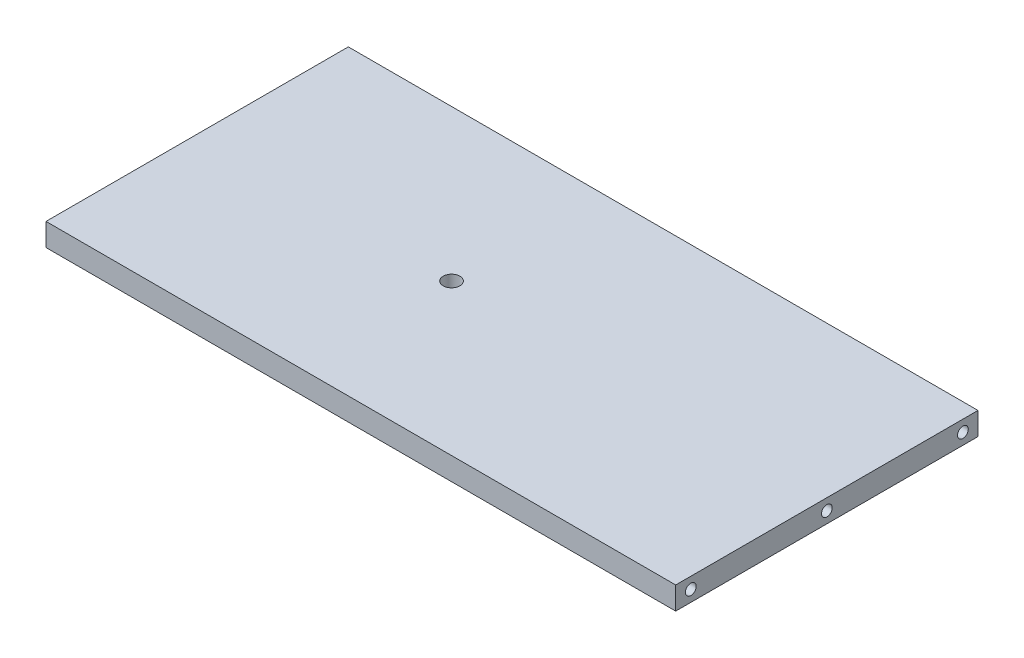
ISO-10303-21;
HEADER;
FILE_DESCRIPTION(('STEP AP214'),'2;1');
FILE_NAME('part.step','',(''),(''),'','','');
FILE_SCHEMA(('AUTOMOTIVE_DESIGN { 1 0 10303 214 1 1 1 1 }'));
ENDSEC;
DATA;
#1=APPLICATION_CONTEXT('core data for automotive mechanical design processes');
#2=APPLICATION_PROTOCOL_DEFINITION('international standard','automotive_design',2000,#1);
#3=PRODUCT_CONTEXT('',#1,'mechanical');
#4=PRODUCT('Part','Part','',(#3));
#5=PRODUCT_RELATED_PRODUCT_CATEGORY('part','',(#4));
#6=PRODUCT_DEFINITION_FORMATION('','',#4);
#7=PRODUCT_DEFINITION_CONTEXT('part definition',#1,'design');
#8=PRODUCT_DEFINITION('design','',#6,#7);
#9=PRODUCT_DEFINITION_SHAPE('','',#8);
#10=(LENGTH_UNIT() NAMED_UNIT(*) SI_UNIT(.MILLI.,.METRE.));
#11=(NAMED_UNIT(*) PLANE_ANGLE_UNIT() SI_UNIT($,.RADIAN.));
#12=(NAMED_UNIT(*) SI_UNIT($,.STERADIAN.) SOLID_ANGLE_UNIT());
#13=UNCERTAINTY_MEASURE_WITH_UNIT(LENGTH_MEASURE(1.E-05),#10,'distance_accuracy_value','');
#14=(GEOMETRIC_REPRESENTATION_CONTEXT(3) GLOBAL_UNCERTAINTY_ASSIGNED_CONTEXT((#13)) GLOBAL_UNIT_ASSIGNED_CONTEXT((#10,
#11,#12)) REPRESENTATION_CONTEXT('',''));
#15=CARTESIAN_POINT('',(0.,0.,0.));
#16=DIRECTION('',(0.,0.,1.));
#17=DIRECTION('',(1.,0.,0.));
#18=AXIS2_PLACEMENT_3D('',#15,#16,#17);
#19=CARTESIAN_POINT('',(66.13525,4.7625,31.75));
#20=DIRECTION('',(-1.,0.,0.));
#21=DIRECTION('',(0.,0.,1.));
#22=AXIS2_PLACEMENT_3D('',#19,#20,#21);
#23=PLANE('',#22);
#24=CARTESIAN_POINT('',(66.13525,2.38125000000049,28.575));
#25=DIRECTION('',(-1.,0.,0.));
#26=DIRECTION('',(0.,0.,-1.));
#27=AXIS2_PLACEMENT_3D('',#24,#25,#26);
#28=CIRCLE('',#27,1.1303);
#29=CARTESIAN_POINT('',(66.13525,2.38125000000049,27.4447));
#30=VERTEX_POINT('',#29);
#31=EDGE_CURVE('E133',#30,#30,#28,.T.);
#32=ORIENTED_EDGE('',*,*,#31,.T.);
#33=EDGE_LOOP('',(#32));
#34=FACE_BOUND('',#33,.T.);
#35=DIRECTION('',(0.,0.,-1.));
#36=VECTOR('',#35,1.);
#37=CARTESIAN_POINT('',(66.13525,0.,31.75));
#38=LINE('',#37,#36);
#39=CARTESIAN_POINT('',(66.13525,0.,31.75));
#40=VERTEX_POINT('',#39);
#41=CARTESIAN_POINT('',(66.13525,0.,-31.75));
#42=VERTEX_POINT('',#41);
#43=EDGE_CURVE('E94',#40,#42,#38,.T.);
#44=ORIENTED_EDGE('',*,*,#43,.T.);
#45=DIRECTION('',(0.,-1.,0.));
#46=VECTOR('',#45,1.);
#47=CARTESIAN_POINT('',(66.13525,4.7625,-31.75));
#48=LINE('',#47,#46);
#49=CARTESIAN_POINT('',(66.13525,4.7625,-31.75));
#50=VERTEX_POINT('',#49);
#51=EDGE_CURVE('E11',#50,#42,#48,.T.);
#52=ORIENTED_EDGE('',*,*,#51,.F.);
#53=DIRECTION('',(0.,0.,-1.));
#54=VECTOR('',#53,1.);
#55=CARTESIAN_POINT('',(66.13525,4.7625,31.75));
#56=LINE('',#55,#54);
#57=CARTESIAN_POINT('',(66.13525,4.7625,31.75));
#58=VERTEX_POINT('',#57);
#59=EDGE_CURVE('E82',#58,#50,#56,.T.);
#60=ORIENTED_EDGE('',*,*,#59,.F.);
#61=DIRECTION('',(0.,-1.,0.));
#62=VECTOR('',#61,1.);
#63=CARTESIAN_POINT('',(66.13525,4.7625,31.75));
#64=LINE('',#63,#62);
#65=EDGE_CURVE('E90',#58,#40,#64,.T.);
#66=ORIENTED_EDGE('',*,*,#65,.T.);
#67=EDGE_LOOP('',(#44,#52,#60,#66));
#68=FACE_BOUND('',#67,.T.);
#69=CARTESIAN_POINT('',(66.13525,2.38125000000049,-28.575));
#70=DIRECTION('',(-1.,0.,0.));
#71=DIRECTION('',(0.,0.,1.));
#72=AXIS2_PLACEMENT_3D('',#69,#70,#71);
#73=CIRCLE('',#72,1.1303);
#74=CARTESIAN_POINT('',(66.13525,2.38125000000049,-27.4447));
#75=VERTEX_POINT('',#74);
#76=EDGE_CURVE('E127',#75,#75,#73,.T.);
#77=ORIENTED_EDGE('',*,*,#76,.T.);
#78=EDGE_LOOP('',(#77));
#79=FACE_BOUND('',#78,.T.);
#80=CARTESIAN_POINT('',(66.13525,2.38125,0.));
#81=DIRECTION('',(-1.,0.,0.));
#82=DIRECTION('',(0.,0.,1.));
#83=AXIS2_PLACEMENT_3D('',#80,#81,#82);
#84=CIRCLE('',#83,1.1303);
#85=CARTESIAN_POINT('',(66.13525,2.38125,1.1303));
#86=VERTEX_POINT('',#85);
#87=EDGE_CURVE('E139',#86,#86,#84,.T.);
#88=ORIENTED_EDGE('',*,*,#87,.T.);
#89=EDGE_LOOP('',(#88));
#90=FACE_BOUND('',#89,.T.);
#91=ADVANCED_FACE('F31',(#34,#68,#79,#90),#23,.F.);
#92=CARTESIAN_POINT('',(-66.13525,4.7625,-31.75));
#93=DIRECTION('',(0.,0.,1.));
#94=DIRECTION('',(1.,0.,0.));
#95=AXIS2_PLACEMENT_3D('',#92,#93,#94);
#96=PLANE('',#95);
#97=DIRECTION('',(-1.,0.,0.));
#98=VECTOR('',#97,1.);
#99=CARTESIAN_POINT('',(-66.13525,0.,-31.75));
#100=LINE('',#99,#98);
#101=CARTESIAN_POINT('',(-66.13525,0.,-31.75));
#102=VERTEX_POINT('',#101);
#103=EDGE_CURVE('E86',#42,#102,#100,.T.);
#104=ORIENTED_EDGE('',*,*,#103,.T.);
#105=DIRECTION('',(0.,-1.,0.));
#106=VECTOR('',#105,1.);
#107=CARTESIAN_POINT('',(-66.13525,4.7625,-31.75));
#108=LINE('',#107,#106);
#109=CARTESIAN_POINT('',(-66.13525,4.7625,-31.75));
#110=VERTEX_POINT('',#109);
#111=EDGE_CURVE('E39',#110,#102,#108,.T.);
#112=ORIENTED_EDGE('',*,*,#111,.F.);
#113=DIRECTION('',(-1.,0.,0.));
#114=VECTOR('',#113,1.);
#115=CARTESIAN_POINT('',(-66.13525,4.7625,-31.75));
#116=LINE('',#115,#114);
#117=EDGE_CURVE('E77',#50,#110,#116,.T.);
#118=ORIENTED_EDGE('',*,*,#117,.F.);
#119=ORIENTED_EDGE('',*,*,#51,.T.);
#120=EDGE_LOOP('',(#104,#112,#118,#119));
#121=FACE_BOUND('',#120,.T.);
#122=ADVANCED_FACE('F85',(#121),#96,.F.);
#123=CARTESIAN_POINT('',(-66.13525,4.7625,31.75));
#124=DIRECTION('',(1.,0.,0.));
#125=DIRECTION('',(0.,0.,-1.));
#126=AXIS2_PLACEMENT_3D('',#123,#124,#125);
#127=PLANE('',#126);
#128=CARTESIAN_POINT('',(-66.13525,2.38125,0.));
#129=DIRECTION('',(-1.,0.,0.));
#130=DIRECTION('',(0.,0.,1.));
#131=AXIS2_PLACEMENT_3D('',#128,#129,#130);
#132=CIRCLE('',#131,1.1303);
#133=CARTESIAN_POINT('',(-66.13525,2.38125,1.1303));
#134=VERTEX_POINT('',#133);
#135=EDGE_CURVE('E121',#134,#134,#132,.T.);
#136=ORIENTED_EDGE('',*,*,#135,.F.);
#137=EDGE_LOOP('',(#136));
#138=FACE_BOUND('',#137,.T.);
#139=CARTESIAN_POINT('',(-66.13525,2.38125000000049,28.575));
#140=DIRECTION('',(-1.,0.,0.));
#141=DIRECTION('',(0.,0.,-1.));
#142=AXIS2_PLACEMENT_3D('',#139,#140,#141);
#143=CIRCLE('',#142,1.1303);
#144=CARTESIAN_POINT('',(-66.13525,2.38125000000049,27.4447));
#145=VERTEX_POINT('',#144);
#146=EDGE_CURVE('E115',#145,#145,#143,.T.);
#147=ORIENTED_EDGE('',*,*,#146,.F.);
#148=EDGE_LOOP('',(#147));
#149=FACE_BOUND('',#148,.T.);
#150=CARTESIAN_POINT('',(-66.13525,2.38125000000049,-28.575));
#151=DIRECTION('',(-1.,0.,0.));
#152=DIRECTION('',(0.,0.,1.));
#153=AXIS2_PLACEMENT_3D('',#150,#151,#152);
#154=CIRCLE('',#153,1.1303);
#155=CARTESIAN_POINT('',(-66.13525,2.38125000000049,-27.4447));
#156=VERTEX_POINT('',#155);
#157=EDGE_CURVE('E109',#156,#156,#154,.T.);
#158=ORIENTED_EDGE('',*,*,#157,.F.);
#159=EDGE_LOOP('',(#158));
#160=FACE_BOUND('',#159,.T.);
#161=DIRECTION('',(0.,0.,1.));
#162=VECTOR('',#161,1.);
#163=CARTESIAN_POINT('',(-66.13525,0.,31.75));
#164=LINE('',#163,#162);
#165=CARTESIAN_POINT('',(-66.13525,0.,31.75));
#166=VERTEX_POINT('',#165);
#167=EDGE_CURVE('E64',#102,#166,#164,.T.);
#168=ORIENTED_EDGE('',*,*,#167,.T.);
#169=DIRECTION('',(0.,-1.,0.));
#170=VECTOR('',#169,1.);
#171=CARTESIAN_POINT('',(-66.13525,4.7625,31.75));
#172=LINE('',#171,#170);
#173=CARTESIAN_POINT('',(-66.13525,4.7625,31.75));
#174=VERTEX_POINT('',#173);
#175=EDGE_CURVE('E87',#174,#166,#172,.T.);
#176=ORIENTED_EDGE('',*,*,#175,.F.);
#177=DIRECTION('',(0.,0.,1.));
#178=VECTOR('',#177,1.);
#179=CARTESIAN_POINT('',(-66.13525,4.7625,31.75));
#180=LINE('',#179,#178);
#181=EDGE_CURVE('E80',#110,#174,#180,.T.);
#182=ORIENTED_EDGE('',*,*,#181,.F.);
#183=ORIENTED_EDGE('',*,*,#111,.T.);
#184=EDGE_LOOP('',(#168,#176,#182,#183));
#185=FACE_BOUND('',#184,.T.);
#186=ADVANCED_FACE('F88',(#138,#149,#160,#185),#127,.F.);
#187=CARTESIAN_POINT('',(-66.13525,4.7625,31.75));
#188=DIRECTION('',(0.,0.,-1.));
#189=DIRECTION('',(-1.,0.,0.));
#190=AXIS2_PLACEMENT_3D('',#187,#188,#189);
#191=PLANE('',#190);
#192=DIRECTION('',(1.,0.,0.));
#193=VECTOR('',#192,1.);
#194=CARTESIAN_POINT('',(-66.13525,0.,31.75));
#195=LINE('',#194,#193);
#196=EDGE_CURVE('E70',#166,#40,#195,.T.);
#197=ORIENTED_EDGE('',*,*,#196,.T.);
#198=ORIENTED_EDGE('',*,*,#65,.F.);
#199=DIRECTION('',(1.,0.,0.));
#200=VECTOR('',#199,1.);
#201=CARTESIAN_POINT('',(-66.13525,4.7625,31.75));
#202=LINE('',#201,#200);
#203=EDGE_CURVE('E47',#174,#58,#202,.T.);
#204=ORIENTED_EDGE('',*,*,#203,.F.);
#205=ORIENTED_EDGE('',*,*,#175,.T.);
#206=EDGE_LOOP('',(#197,#198,#204,#205));
#207=FACE_BOUND('',#206,.T.);
#208=ADVANCED_FACE('F102',(#207),#191,.F.);
#209=CARTESIAN_POINT('',(66.13525,4.7625,-31.75));
#210=DIRECTION('',(0.,-1.,0.));
#211=DIRECTION('',(0.,0.,-1.));
#212=AXIS2_PLACEMENT_3D('',#209,#210,#211);
#213=PLANE('',#212);
#214=CARTESIAN_POINT('',(-12.7,4.7625,0.));
#215=DIRECTION('',(0.,1.,0.));
#216=DIRECTION('',(0.,0.,1.));
#217=AXIS2_PLACEMENT_3D('',#214,#215,#216);
#218=CIRCLE('',#217,1.75895);
#219=CARTESIAN_POINT('',(-12.7,4.7625,1.75895));
#220=VERTEX_POINT('',#219);
#221=EDGE_CURVE('E145',#220,#220,#218,.T.);
#222=ORIENTED_EDGE('',*,*,#221,.F.);
#223=EDGE_LOOP('',(#222));
#224=FACE_BOUND('',#223,.T.);
#225=ORIENTED_EDGE('',*,*,#59,.T.);
#226=ORIENTED_EDGE('',*,*,#117,.T.);
#227=ORIENTED_EDGE('',*,*,#181,.T.);
#228=ORIENTED_EDGE('',*,*,#203,.T.);
#229=EDGE_LOOP('',(#225,#226,#227,#228));
#230=FACE_BOUND('',#229,.T.);
#231=ADVANCED_FACE('F78',(#224,#230),#213,.F.);
#232=CARTESIAN_POINT('',(66.13525,0.,-31.75));
#233=DIRECTION('',(0.,-1.,0.));
#234=DIRECTION('',(0.,0.,-1.));
#235=AXIS2_PLACEMENT_3D('',#232,#233,#234);
#236=PLANE('',#235);
#237=CARTESIAN_POINT('',(-12.7,0.,0.));
#238=DIRECTION('',(0.,1.,0.));
#239=DIRECTION('',(0.,0.,1.));
#240=AXIS2_PLACEMENT_3D('',#237,#238,#239);
#241=CIRCLE('',#240,1.75895);
#242=CARTESIAN_POINT('',(-12.7,0.,1.75895));
#243=VERTEX_POINT('',#242);
#244=EDGE_CURVE('E142',#243,#243,#241,.T.);
#245=ORIENTED_EDGE('',*,*,#244,.T.);
#246=EDGE_LOOP('',(#245));
#247=FACE_BOUND('',#246,.T.);
#248=ORIENTED_EDGE('',*,*,#43,.F.);
#249=ORIENTED_EDGE('',*,*,#196,.F.);
#250=ORIENTED_EDGE('',*,*,#167,.F.);
#251=ORIENTED_EDGE('',*,*,#103,.F.);
#252=EDGE_LOOP('',(#248,#249,#250,#251));
#253=FACE_BOUND('',#252,.T.);
#254=ADVANCED_FACE('F105',(#247,#253),#236,.T.);
#255=CARTESIAN_POINT('',(-55.97525,2.38125000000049,-28.575));
#256=DIRECTION('',(-1.,0.,0.));
#257=DIRECTION('',(0.,0.,1.));
#258=AXIS2_PLACEMENT_3D('',#255,#256,#257);
#259=CYLINDRICAL_SURFACE('',#258,1.1303);
#260=CARTESIAN_POINT('',(-55.97525,2.38125000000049,-28.575));
#261=DIRECTION('',(-1.,0.,0.));
#262=DIRECTION('',(0.,0.,1.));
#263=AXIS2_PLACEMENT_3D('',#260,#261,#262);
#264=CIRCLE('',#263,1.1303);
#265=CARTESIAN_POINT('',(-55.97525,2.38125000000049,-27.4447));
#266=VERTEX_POINT('',#265);
#267=EDGE_CURVE('E97',#266,#266,#264,.T.);
#268=ORIENTED_EDGE('',*,*,#267,.F.);
#269=EDGE_LOOP('',(#268));
#270=FACE_BOUND('',#269,.T.);
#271=ORIENTED_EDGE('',*,*,#157,.T.);
#272=EDGE_LOOP('',(#271));
#273=FACE_BOUND('',#272,.T.);
#274=ADVANCED_FACE('F165',(#270,#273),#259,.F.);
#275=CARTESIAN_POINT('',(-55.97525,2.38125000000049,-28.575));
#276=DIRECTION('',(-1.,0.,0.));
#277=DIRECTION('',(0.,0.,1.));
#278=AXIS2_PLACEMENT_3D('',#275,#276,#277);
#279=PLANE('',#278);
#280=ORIENTED_EDGE('',*,*,#267,.T.);
#281=EDGE_LOOP('',(#280));
#282=FACE_BOUND('',#281,.T.);
#283=ADVANCED_FACE('F212',(#282),#279,.T.);
#284=CARTESIAN_POINT('',(-55.97525,2.38125000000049,28.575));
#285=DIRECTION('',(-1.,0.,0.));
#286=DIRECTION('',(0.,0.,1.));
#287=AXIS2_PLACEMENT_3D('',#284,#285,#286);
#288=CYLINDRICAL_SURFACE('',#287,1.1303);
#289=CARTESIAN_POINT('',(-55.97525,2.38125000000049,28.575));
#290=DIRECTION('',(-1.,0.,0.));
#291=DIRECTION('',(0.,0.,-1.));
#292=AXIS2_PLACEMENT_3D('',#289,#290,#291);
#293=CIRCLE('',#292,1.1303);
#294=CARTESIAN_POINT('',(-55.97525,2.38125000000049,27.4447));
#295=VERTEX_POINT('',#294);
#296=EDGE_CURVE('E112',#295,#295,#293,.T.);
#297=ORIENTED_EDGE('',*,*,#296,.F.);
#298=EDGE_LOOP('',(#297));
#299=FACE_BOUND('',#298,.T.);
#300=ORIENTED_EDGE('',*,*,#146,.T.);
#301=EDGE_LOOP('',(#300));
#302=FACE_BOUND('',#301,.T.);
#303=ADVANCED_FACE('F208',(#299,#302),#288,.F.);
#304=CARTESIAN_POINT('',(-55.97525,2.38125000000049,28.575));
#305=DIRECTION('',(1.,0.,0.));
#306=DIRECTION('',(0.,0.,-1.));
#307=AXIS2_PLACEMENT_3D('',#304,#305,#306);
#308=PLANE('',#307);
#309=ORIENTED_EDGE('',*,*,#296,.T.);
#310=EDGE_LOOP('',(#309));
#311=FACE_BOUND('',#310,.T.);
#312=ADVANCED_FACE('F204',(#311),#308,.F.);
#313=CARTESIAN_POINT('',(-55.97525,2.38125,0.));
#314=DIRECTION('',(-1.,0.,0.));
#315=DIRECTION('',(0.,0.,1.));
#316=AXIS2_PLACEMENT_3D('',#313,#314,#315);
#317=CYLINDRICAL_SURFACE('',#316,1.1303);
#318=CARTESIAN_POINT('',(-55.97525,2.38125,0.));
#319=DIRECTION('',(-1.,0.,0.));
#320=DIRECTION('',(0.,0.,1.));
#321=AXIS2_PLACEMENT_3D('',#318,#319,#320);
#322=CIRCLE('',#321,1.1303);
#323=CARTESIAN_POINT('',(-55.97525,2.38125,1.1303));
#324=VERTEX_POINT('',#323);
#325=EDGE_CURVE('E118',#324,#324,#322,.T.);
#326=ORIENTED_EDGE('',*,*,#325,.F.);
#327=EDGE_LOOP('',(#326));
#328=FACE_BOUND('',#327,.T.);
#329=ORIENTED_EDGE('',*,*,#135,.T.);
#330=EDGE_LOOP('',(#329));
#331=FACE_BOUND('',#330,.T.);
#332=ADVANCED_FACE('F200',(#328,#331),#317,.F.);
#333=CARTESIAN_POINT('',(-55.97525,2.38125,0.));
#334=DIRECTION('',(-1.,0.,0.));
#335=DIRECTION('',(0.,0.,1.));
#336=AXIS2_PLACEMENT_3D('',#333,#334,#335);
#337=PLANE('',#336);
#338=ORIENTED_EDGE('',*,*,#325,.T.);
#339=EDGE_LOOP('',(#338));
#340=FACE_BOUND('',#339,.T.);
#341=ADVANCED_FACE('F196',(#340),#337,.T.);
#342=CARTESIAN_POINT('',(55.97525,2.38125000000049,-28.575));
#343=DIRECTION('',(1.,0.,0.));
#344=DIRECTION('',(0.,0.,-1.));
#345=AXIS2_PLACEMENT_3D('',#342,#343,#344);
#346=CYLINDRICAL_SURFACE('',#345,1.1303);
#347=CARTESIAN_POINT('',(55.97525,2.38125000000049,-28.575));
#348=DIRECTION('',(-1.,0.,0.));
#349=DIRECTION('',(0.,0.,1.));
#350=AXIS2_PLACEMENT_3D('',#347,#348,#349);
#351=CIRCLE('',#350,1.1303);
#352=CARTESIAN_POINT('',(55.97525,2.38125000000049,-27.4447));
#353=VERTEX_POINT('',#352);
#354=EDGE_CURVE('E124',#353,#353,#351,.T.);
#355=ORIENTED_EDGE('',*,*,#354,.T.);
#356=EDGE_LOOP('',(#355));
#357=FACE_BOUND('',#356,.T.);
#358=ORIENTED_EDGE('',*,*,#76,.F.);
#359=EDGE_LOOP('',(#358));
#360=FACE_BOUND('',#359,.T.);
#361=ADVANCED_FACE('F189',(#357,#360),#346,.F.);
#362=CARTESIAN_POINT('',(55.97525,2.38125000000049,-28.575));
#363=DIRECTION('',(1.,0.,0.));
#364=DIRECTION('',(0.,0.,1.));
#365=AXIS2_PLACEMENT_3D('',#362,#363,#364);
#366=PLANE('',#365);
#367=ORIENTED_EDGE('',*,*,#354,.F.);
#368=EDGE_LOOP('',(#367));
#369=FACE_BOUND('',#368,.T.);
#370=ADVANCED_FACE('F179',(#369),#366,.T.);
#371=CARTESIAN_POINT('',(55.97525,2.38125000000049,28.575));
#372=DIRECTION('',(1.,0.,0.));
#373=DIRECTION('',(0.,0.,-1.));
#374=AXIS2_PLACEMENT_3D('',#371,#372,#373);
#375=CYLINDRICAL_SURFACE('',#374,1.1303);
#376=CARTESIAN_POINT('',(55.97525,2.38125000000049,28.575));
#377=DIRECTION('',(-1.,0.,0.));
#378=DIRECTION('',(0.,0.,-1.));
#379=AXIS2_PLACEMENT_3D('',#376,#377,#378);
#380=CIRCLE('',#379,1.1303);
#381=CARTESIAN_POINT('',(55.97525,2.38125000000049,27.4447));
#382=VERTEX_POINT('',#381);
#383=EDGE_CURVE('E130',#382,#382,#380,.T.);
#384=ORIENTED_EDGE('',*,*,#383,.T.);
#385=EDGE_LOOP('',(#384));
#386=FACE_BOUND('',#385,.T.);
#387=ORIENTED_EDGE('',*,*,#31,.F.);
#388=EDGE_LOOP('',(#387));
#389=FACE_BOUND('',#388,.T.);
#390=ADVANCED_FACE('F176',(#386,#389),#375,.F.);
#391=CARTESIAN_POINT('',(55.97525,2.38125000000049,28.575));
#392=DIRECTION('',(-1.,0.,0.));
#393=DIRECTION('',(0.,0.,-1.));
#394=AXIS2_PLACEMENT_3D('',#391,#392,#393);
#395=PLANE('',#394);
#396=ORIENTED_EDGE('',*,*,#383,.F.);
#397=EDGE_LOOP('',(#396));
#398=FACE_BOUND('',#397,.T.);
#399=ADVANCED_FACE('F178',(#398),#395,.F.);
#400=CARTESIAN_POINT('',(55.97525,2.38125,0.));
#401=DIRECTION('',(1.,0.,0.));
#402=DIRECTION('',(0.,0.,-1.));
#403=AXIS2_PLACEMENT_3D('',#400,#401,#402);
#404=CYLINDRICAL_SURFACE('',#403,1.1303);
#405=CARTESIAN_POINT('',(55.97525,2.38125,0.));
#406=DIRECTION('',(-1.,0.,0.));
#407=DIRECTION('',(0.,0.,1.));
#408=AXIS2_PLACEMENT_3D('',#405,#406,#407);
#409=CIRCLE('',#408,1.1303);
#410=CARTESIAN_POINT('',(55.97525,2.38125,1.1303));
#411=VERTEX_POINT('',#410);
#412=EDGE_CURVE('E136',#411,#411,#409,.T.);
#413=ORIENTED_EDGE('',*,*,#412,.T.);
#414=EDGE_LOOP('',(#413));
#415=FACE_BOUND('',#414,.T.);
#416=ORIENTED_EDGE('',*,*,#87,.F.);
#417=EDGE_LOOP('',(#416));
#418=FACE_BOUND('',#417,.T.);
#419=ADVANCED_FACE('F186',(#415,#418),#404,.F.);
#420=CARTESIAN_POINT('',(55.97525,2.38125,0.));
#421=DIRECTION('',(1.,0.,0.));
#422=DIRECTION('',(0.,0.,1.));
#423=AXIS2_PLACEMENT_3D('',#420,#421,#422);
#424=PLANE('',#423);
#425=ORIENTED_EDGE('',*,*,#412,.F.);
#426=EDGE_LOOP('',(#425));
#427=FACE_BOUND('',#426,.T.);
#428=ADVANCED_FACE('F155',(#427),#424,.T.);
#429=CARTESIAN_POINT('',(-12.7,0.,0.));
#430=DIRECTION('',(0.,1.,0.));
#431=DIRECTION('',(0.,0.,1.));
#432=AXIS2_PLACEMENT_3D('',#429,#430,#431);
#433=CYLINDRICAL_SURFACE('',#432,1.75895);
#434=CARTESIAN_POINT('',(-12.7,0.,1.75895));
#435=CARTESIAN_POINT('',(-12.7,0.049609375,1.75895));
#436=CARTESIAN_POINT('',(-12.7,0.09921875,1.75895));
#437=CARTESIAN_POINT('',(-12.7,0.1984375,1.75895));
#438=CARTESIAN_POINT('',(-12.7,0.248046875,1.75895));
#439=CARTESIAN_POINT('',(-12.7,0.347265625,1.75895));
#440=CARTESIAN_POINT('',(-12.7,0.396875,1.75895));
#441=CARTESIAN_POINT('',(-12.7,0.49609375,1.75895));
#442=CARTESIAN_POINT('',(-12.7,0.545703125,1.75895));
#443=CARTESIAN_POINT('',(-12.7,0.644921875,1.75895));
#444=CARTESIAN_POINT('',(-12.7,0.69453125,1.75895));
#445=CARTESIAN_POINT('',(-12.7,0.79375,1.75895));
#446=CARTESIAN_POINT('',(-12.7,0.843359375,1.75895));
#447=CARTESIAN_POINT('',(-12.7,0.942578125,1.75895));
#448=CARTESIAN_POINT('',(-12.7,0.9921875,1.75895));
#449=CARTESIAN_POINT('',(-12.7,1.09140625,1.75895));
#450=CARTESIAN_POINT('',(-12.7,1.141015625,1.75895));
#451=CARTESIAN_POINT('',(-12.7,1.240234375,1.75895));
#452=CARTESIAN_POINT('',(-12.7,1.28984375,1.75895));
#453=CARTESIAN_POINT('',(-12.7,1.3890625,1.75895));
#454=CARTESIAN_POINT('',(-12.7,1.438671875,1.75895));
#455=CARTESIAN_POINT('',(-12.7,1.537890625,1.75895));
#456=CARTESIAN_POINT('',(-12.7,1.5875,1.75895));
#457=CARTESIAN_POINT('',(-12.7,1.68671875,1.75895));
#458=CARTESIAN_POINT('',(-12.7,1.736328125,1.75895));
#459=CARTESIAN_POINT('',(-12.7,1.835546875,1.75895));
#460=CARTESIAN_POINT('',(-12.7,1.88515625,1.75895));
#461=CARTESIAN_POINT('',(-12.7,1.984375,1.75895));
#462=CARTESIAN_POINT('',(-12.7,2.033984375,1.75895));
#463=CARTESIAN_POINT('',(-12.7,2.133203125,1.75895));
#464=CARTESIAN_POINT('',(-12.7,2.1828125,1.75895));
#465=CARTESIAN_POINT('',(-12.7,2.28203125,1.75895));
#466=CARTESIAN_POINT('',(-12.7,2.331640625,1.75895));
#467=CARTESIAN_POINT('',(-12.7,2.430859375,1.75895));
#468=CARTESIAN_POINT('',(-12.7,2.48046875,1.75895));
#469=CARTESIAN_POINT('',(-12.7,2.5796875,1.75895));
#470=CARTESIAN_POINT('',(-12.7,2.629296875,1.75895));
#471=CARTESIAN_POINT('',(-12.7,2.728515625,1.75895));
#472=CARTESIAN_POINT('',(-12.7,2.778125,1.75895));
#473=CARTESIAN_POINT('',(-12.7,2.87734375,1.75895));
#474=CARTESIAN_POINT('',(-12.7,2.926953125,1.75895));
#475=CARTESIAN_POINT('',(-12.7,3.026171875,1.75895));
#476=CARTESIAN_POINT('',(-12.7,3.07578125,1.75895));
#477=CARTESIAN_POINT('',(-12.7,3.175,1.75895));
#478=CARTESIAN_POINT('',(-12.7,3.224609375,1.75895));
#479=CARTESIAN_POINT('',(-12.7,3.323828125,1.75895));
#480=CARTESIAN_POINT('',(-12.7,3.3734375,1.75895));
#481=CARTESIAN_POINT('',(-12.7,3.47265625,1.75895));
#482=CARTESIAN_POINT('',(-12.7,3.522265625,1.75895));
#483=CARTESIAN_POINT('',(-12.7,3.621484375,1.75895));
#484=CARTESIAN_POINT('',(-12.7,3.67109375,1.75895));
#485=CARTESIAN_POINT('',(-12.7,3.7703125,1.75895));
#486=CARTESIAN_POINT('',(-12.7,3.819921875,1.75895));
#487=CARTESIAN_POINT('',(-12.7,3.919140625,1.75895));
#488=CARTESIAN_POINT('',(-12.7,3.96875,1.75895));
#489=CARTESIAN_POINT('',(-12.7,4.06796875,1.75895));
#490=CARTESIAN_POINT('',(-12.7,4.117578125,1.75895));
#491=CARTESIAN_POINT('',(-12.7,4.216796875,1.75895));
#492=CARTESIAN_POINT('',(-12.7,4.26640625,1.75895));
#493=CARTESIAN_POINT('',(-12.7,4.365625,1.75895));
#494=CARTESIAN_POINT('',(-12.7,4.415234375,1.75895));
#495=CARTESIAN_POINT('',(-12.7,4.514453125,1.75895));
#496=CARTESIAN_POINT('',(-12.7,4.5640625,1.75895));
#497=CARTESIAN_POINT('',(-12.7,4.66328125,1.75895));
#498=CARTESIAN_POINT('',(-12.7,4.712890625,1.75895));
#499=CARTESIAN_POINT('',(-12.7,4.7625,1.75895));
#500=B_SPLINE_CURVE_WITH_KNOTS('',3,(#434,#435,#436,#437,#438,#439,#440,#441,#442,#443,#444,
#445,#446,#447,#448,#449,#450,#451,#452,#453,#454,#455,#456,#457,#458,#459,#460,#461,#462,#463,
#464,#465,#466,#467,#468,#469,#470,#471,#472,#473,#474,#475,#476,#477,#478,#479,#480,#481,#482,
#483,#484,#485,#486,#487,#488,#489,#490,#491,#492,#493,#494,#495,#496,#497,#498,#499),
.UNSPECIFIED.,.F.,.F.,(4,2,2,2,2,2,2,2,2,2,2,2,2,2,2,2,2,2,2,2,2,2,2,2,2,2,2,2,2,2,2,2,4),(0.,
0.148828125,0.29765625,0.446484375,0.5953125,0.744140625,0.89296875,1.041796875,1.190625,
1.339453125,1.48828125,1.637109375,1.7859375,1.934765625,2.08359375,2.232421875,2.38125,
2.530078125,2.67890625,2.827734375,2.9765625,3.125390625,3.27421875,3.423046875,3.571875,
3.720703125,3.86953125,4.018359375,4.1671875,4.316015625,4.46484375,4.613671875,4.7625),.UNSPECIFIED.);
#501=EDGE_CURVE('BSEAM152',#243,#220,#500,.T.);
#502=ORIENTED_EDGE('',*,*,#244,.F.);
#503=ORIENTED_EDGE('',*,*,#221,.T.);
#504=ORIENTED_EDGE('',*,*,#501,.T.);
#505=ORIENTED_EDGE('',*,*,#501,.F.);
#506=EDGE_LOOP('',(#502,#504,#503,#505));
#507=FACE_BOUND('',#506,.T.);
#508=ADVANCED_FACE('F152',(#507),#433,.F.);
#509=CLOSED_SHELL('',(#91,#122,#186,#208,#231,#254,#274,#283,#303,#312,#332,#341,#361,#370,#390,
#399,#419,#428,#508));
#510=MANIFOLD_SOLID_BREP('B2',#509);
#511=ADVANCED_BREP_SHAPE_REPRESENTATION('',(#18,#510),#14);
#512=SHAPE_DEFINITION_REPRESENTATION(#9,#511);
ENDSEC;
END-ISO-10303-21;
